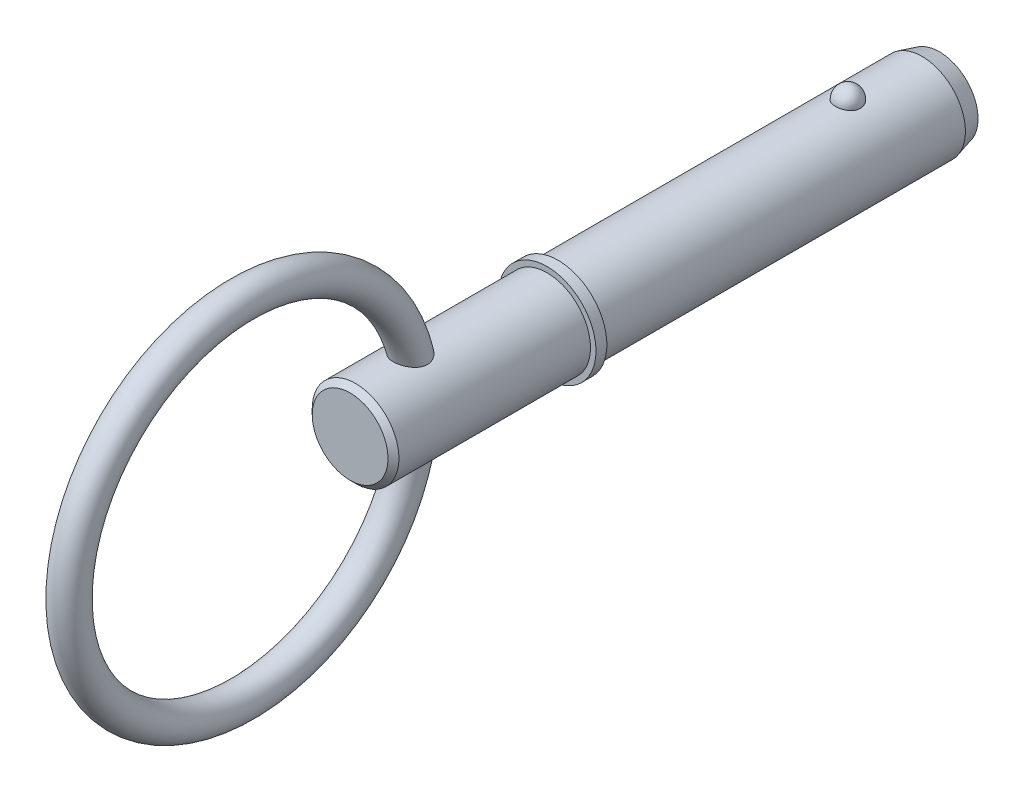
from build123d import *

# Parameters (mm, degrees)
SKETCH2_R           = 3.97
BOSS_EXTRUDE1_DEPTH = 25.4
BOSS_EXTRUDE2_START = 9.53
SKETCH3_R           = 3.97
BOSS_EXTRUDE2_DEPTH = 9.53
CHAMFER1_SIZE       = 1.586
CHAMFER1_SIZE2      = 0.424967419
SKETCH20_W          = 1
SKETCH20_H          = 4.47
SKETCH21_R          = 3.97
BOSS_EXTRUDE3_DEPTH = 19.05
CHAMFER2_SIZE       = 0.5
SKETCH24_R          = 1.5


with BuildPart() as part:
    # Sketch2 → Boss-Extrude1 (new body)
    with BuildSketch(Plane.XY):
        Circle(SKETCH2_R)
    extrude(amount=BOSS_EXTRUDE1_DEPTH)

    # Sketch3 → Boss-Extrude2 (add)
    with BuildSketch(Plane(origin=(0, 0, 0), x_dir=(-1, 0, 0), z_dir=(0, 0, -1)).offset(BOSS_EXTRUDE2_START)):
        Circle(SKETCH3_R)
    extrude(amount=-BOSS_EXTRUDE2_DEPTH)

    # Chamfer1
    chamfer1_edges = [part.edges().sort_by_distance(p)[0] for p in [
        (3.97, 0, -9.53),
    ]]
    chamfer1_side = [part.faces().sort_by_distance(p)[0] for p in [
        (3.97, 0, -4.765),
    ]]
    chamfer(chamfer1_edges, length=CHAMFER1_SIZE, length2=CHAMFER1_SIZE2, reference=chamfer1_side[0])

    # Sketch18 → Revolve1 (revolve)
    with BuildSketch(Plane(origin=(0, 0, 0), x_dir=(0, 0, -1), z_dir=(1, 0, 0))):
        with BuildLine():
            Line((1.15, 5.12), (1.15, 2.82))
            ThreePointArc((1.15, 2.82), (0, 3.97), (1.15, 5.12))
        make_face()
    revolve(axis=Axis((0, 5.12, -1.15), (0, -1, 0)))

    # Sketch20 → Revolve2 (revolve)
    with BuildSketch(Plane(origin=(0, 0, 0), x_dir=(0, 0, -1), z_dir=(1, 0, 0)), mode=Mode.PRIVATE) as revolve2_sk:
        with Locations((-25.9, 2.235)):
            Rectangle(SKETCH20_W, SKETCH20_H)
    revolve(revolve2_sk.sketch.rotate(Axis((0, 0, 33.728787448), (0, 0, 1)), 90), axis=Axis((0, 0, 33.728787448), (0, 0, 1)))

    # Sketch21 → Boss-Extrude3 (add)
    with BuildSketch(Plane(origin=(0, 0, 25.4), x_dir=(-1, 0, 0), z_dir=(0, 0, -1))):
        Circle(SKETCH21_R)
    extrude(amount=-BOSS_EXTRUDE3_DEPTH)

    # Chamfer2
    chamfer2_edges = [part.edges().sort_by_distance(p)[0] for p in [
        (3.97, 0, 44.45),
    ]]
    chamfer(chamfer2_edges, length=CHAMFER2_SIZE)

    # Sweep1: sweep along a path in Sketch23
    with BuildLine(Plane(origin=(0, 0, 0), x_dir=(0, 0, -1), z_dir=(1, 0, 0))) as sweep1_path:
        CenterArc((-54.325, 0), 15.875, 0, 360)
    # Sketch24 → Sweep1 (sweep)
    with BuildSketch(Plane(origin=(0, 0, 0), x_dir=(1, 0, 0), z_dir=(0, 1, 0))):
        with Locations((0, -38.45)):
            Circle(SKETCH24_R)
    sweep(path=sweep1_path.line)


solid = part.part
